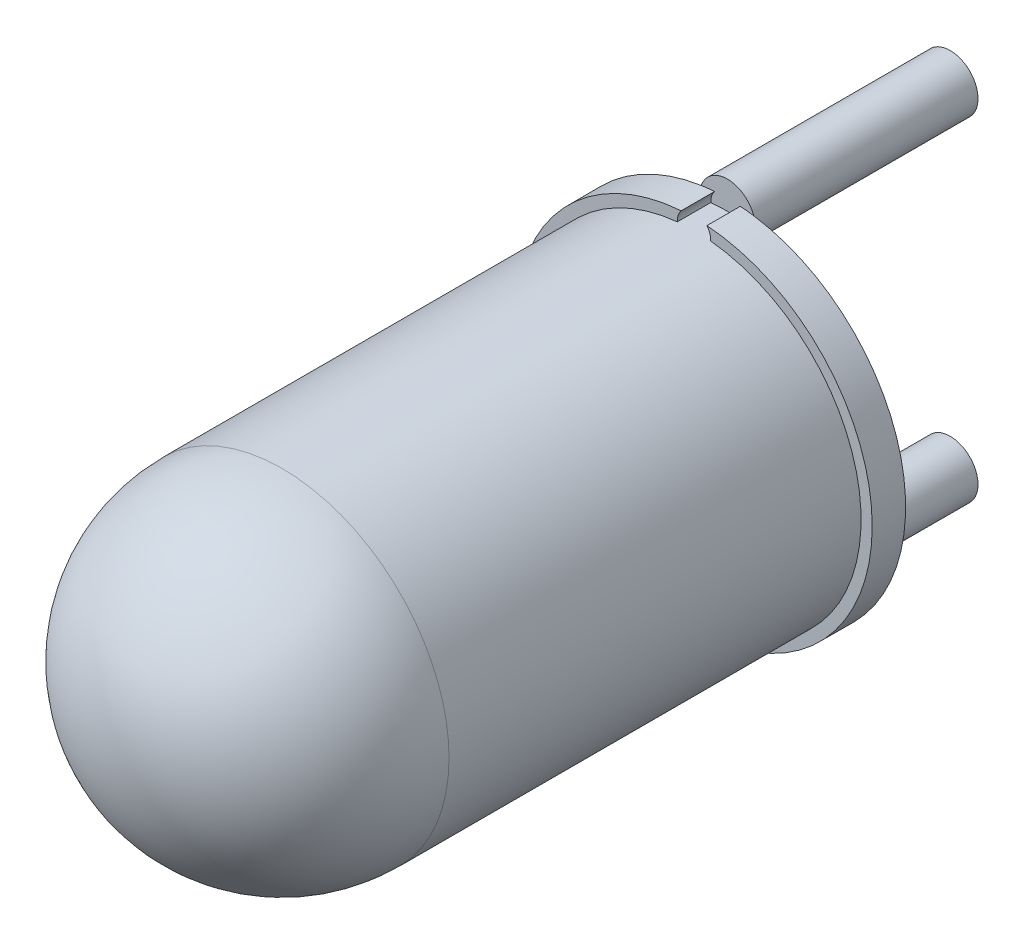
from build123d import *

# Parameters (mm, degrees)
SKETCH1_R           = 1.5
BASE_EXTRUDE_DEPTH  = 4
SKETCH3_R           = 0.25
BOSS_EXTRUDE1_DEPTH = 2
BOSS_EXTRUDE2_DEPTH = 0.3


with BuildPart() as part:
    # Sketch1 → Base-Extrude (new body)
    with BuildSketch(Plane.XY):
        with Locations(Location((0, 0, 0), (0, 0, 95.731967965))):
            Circle(SKETCH1_R)
    extrude(amount=BASE_EXTRUDE_DEPTH)

    # Sketch2 one side → Boss-Revolve1 (revolve)
    with BuildSketch(Plane.XY.offset(4)):
        with BuildLine():
            Line((-1.5, 0), (1.5, 0))
            ThreePointArc((1.5, 0), (0, 1.5), (-1.5, 0))
        make_face()
        with BuildLine():
            Line((-1.5, 0), (1.5, 0))
            ThreePointArc((1.5, 0), (0, 1.5), (-1.5, 0))
        make_face()
    revolve(axis=Axis((-1.228070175, 0, 4), (1, 0, 0)))

    # Sketch3 → Boss-Extrude1 (add)
    with BuildSketch(Plane(origin=(0, 0, 0), x_dir=(-1, 0, 0), z_dir=(0, 0, -1))):
        with Locations(Location((0, -1.5, 0), (0, 0, 199.268775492))):
            Circle(SKETCH3_R)
        with Locations(Location((0, 1.5, 0), (0, 0, 160.731224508))):
            Circle(SKETCH3_R)
    extrude(amount=BOSS_EXTRUDE1_DEPTH)

    # Sketch4 → Boss-Extrude2 (add)
    with BuildSketch(Plane(origin=(0, 0, 0), x_dir=(-1, 0, 0), z_dir=(0, 0, -1))):
        with BuildLine():
            ThreePointArc((-0.115394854, 1.595833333), (0, 1.35), (0.115394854, 1.595833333))
            ThreePointArc((0.115394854, 1.595833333), (1.6, 0), (0.115394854, -1.595833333))
            ThreePointArc((0.115394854, -1.595833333), (0, -1.35), (-0.115394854, -1.595833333))
            ThreePointArc((-0.115394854, -1.595833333), (-1.6, 0), (-0.115394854, 1.595833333))
        make_face()
        with BuildLine():
            ThreePointArc((-0.249130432, 1.479166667), (0, 1.25), (0.249130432, 1.479166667))
            ThreePointArc((0.249130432, 1.479166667), (1.5, 0), (0.249130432, -1.479166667))
            ThreePointArc((0.249130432, -1.479166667), (0, -1.25), (-0.249130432, -1.479166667))
            ThreePointArc((-0.249130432, -1.479166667), (-1.5, 0), (-0.249130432, 1.479166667))
        make_face(mode=Mode.SUBTRACT)
    extrude(amount=-BOSS_EXTRUDE2_DEPTH)


solid = part.part
